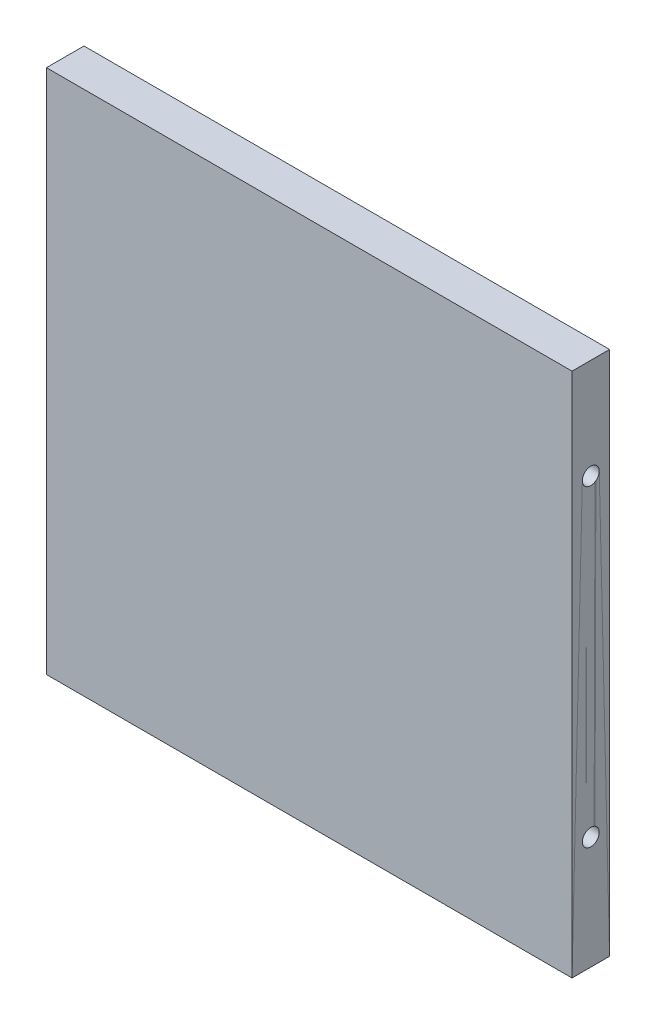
ISO-10303-21;
HEADER;
FILE_DESCRIPTION(('STEP AP214'),'2;1');
FILE_NAME('part.step','',(''),(''),'','','');
FILE_SCHEMA(('AUTOMOTIVE_DESIGN { 1 0 10303 214 1 1 1 1 }'));
ENDSEC;
DATA;
#1=APPLICATION_CONTEXT('core data for automotive mechanical design processes');
#2=APPLICATION_PROTOCOL_DEFINITION('international standard','automotive_design',2000,#1);
#3=PRODUCT_CONTEXT('',#1,'mechanical');
#4=PRODUCT('Part','Part','',(#3));
#5=PRODUCT_RELATED_PRODUCT_CATEGORY('part','',(#4));
#6=PRODUCT_DEFINITION_FORMATION('','',#4);
#7=PRODUCT_DEFINITION_CONTEXT('part definition',#1,'design');
#8=PRODUCT_DEFINITION('design','',#6,#7);
#9=PRODUCT_DEFINITION_SHAPE('','',#8);
#10=(LENGTH_UNIT() NAMED_UNIT(*) SI_UNIT(.MILLI.,.METRE.));
#11=(NAMED_UNIT(*) PLANE_ANGLE_UNIT() SI_UNIT($,.RADIAN.));
#12=(NAMED_UNIT(*) SI_UNIT($,.STERADIAN.) SOLID_ANGLE_UNIT());
#13=UNCERTAINTY_MEASURE_WITH_UNIT(LENGTH_MEASURE(1.E-05),#10,'distance_accuracy_value','');
#14=(GEOMETRIC_REPRESENTATION_CONTEXT(3) GLOBAL_UNCERTAINTY_ASSIGNED_CONTEXT((#13)) GLOBAL_UNIT_ASSIGNED_CONTEXT((#10,
#11,#12)) REPRESENTATION_CONTEXT('',''));
#15=CARTESIAN_POINT('',(0.,0.,0.));
#16=DIRECTION('',(0.,0.,1.));
#17=DIRECTION('',(1.,0.,0.));
#18=AXIS2_PLACEMENT_3D('',#15,#16,#17);
#19=CARTESIAN_POINT('',(120.,45.,-7.5));
#20=DIRECTION('',(1.,0.,0.));
#21=DIRECTION('',(0.,0.,-1.));
#22=AXIS2_PLACEMENT_3D('',#19,#20,#21);
#23=CONICAL_SURFACE('',#22,3.37499999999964,1.04719755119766);
#24=CARTESIAN_POINT('',(120.,45.,-7.5));
#25=DIRECTION('',(-1.,0.,0.));
#26=DIRECTION('',(0.,-0.8090169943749,-0.587785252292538));
#27=AXIS2_PLACEMENT_3D('',#24,#25,#26);
#28=CIRCLE('',#27,3.37499999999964);
#29=CARTESIAN_POINT('',(120.,42.269567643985,-9.4837752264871));
#30=VERTEX_POINT('',#29);
#31=EDGE_CURVE('P0_E515',#30,#30,#28,.T.);
#32=ORIENTED_EDGE('',*,*,#31,.F.);
#33=EDGE_LOOP('',(#32));
#34=FACE_BOUND('',#33,.T.);
#35=CARTESIAN_POINT('',(118.05144284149,45.,-7.5));
#36=VERTEX_POINT('',#35);
#37=VERTEX_LOOP('',#36);
#38=FACE_BOUND('',#37,.T.);
#39=ADVANCED_FACE('P0_F348',(#34,#38),#23,.F.);
#40=CARTESIAN_POINT('',(120.,170.,-7.5));
#41=DIRECTION('',(1.,0.,0.));
#42=DIRECTION('',(0.,0.,-1.));
#43=AXIS2_PLACEMENT_3D('',#40,#41,#42);
#44=CONICAL_SURFACE('',#43,3.37500000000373,1.04719755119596);
#45=CARTESIAN_POINT('',(120.,170.,-7.5));
#46=DIRECTION('',(-1.,0.,0.));
#47=DIRECTION('',(0.,-0.809016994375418,-0.587785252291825));
#48=AXIS2_PLACEMENT_3D('',#45,#46,#47);
#49=CIRCLE('',#48,3.37500000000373);
#50=CARTESIAN_POINT('',(120.,167.26956764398,-9.4837752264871));
#51=VERTEX_POINT('',#50);
#52=EDGE_CURVE('P0_E511',#51,#51,#49,.T.);
#53=ORIENTED_EDGE('',*,*,#52,.F.);
#54=EDGE_LOOP('',(#53));
#55=FACE_BOUND('',#54,.T.);
#56=CARTESIAN_POINT('',(118.05144284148,170.,-7.5));
#57=VERTEX_POINT('',#56);
#58=VERTEX_LOOP('',#57);
#59=FACE_BOUND('',#58,.T.);
#60=ADVANCED_FACE('P0_F408',(#55,#59),#44,.F.);
#61=CARTESIAN_POINT('',(-28.051442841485,45.,-7.5));
#62=DIRECTION('',(-1.,0.,0.));
#63=DIRECTION('',(0.,0.,1.));
#64=AXIS2_PLACEMENT_3D('',#61,#62,#63);
#65=CONICAL_SURFACE('',#64,0.,1.04719755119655);
#66=CARTESIAN_POINT('',(-30.,45.,-7.5));
#67=DIRECTION('',(-1.,0.,0.));
#68=DIRECTION('',(0.,-0.8090169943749,-0.587785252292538));
#69=AXIS2_PLACEMENT_3D('',#66,#67,#68);
#70=CIRCLE('',#69,3.37499999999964);
#71=CARTESIAN_POINT('',(-30.,42.269567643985,-9.4837752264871));
#72=VERTEX_POINT('',#71);
#73=EDGE_CURVE('P0_E509',#72,#72,#70,.F.);
#74=ORIENTED_EDGE('',*,*,#73,.F.);
#75=EDGE_LOOP('',(#74));
#76=FACE_BOUND('',#75,.T.);
#77=CARTESIAN_POINT('',(-28.051442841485,45.,-7.5));
#78=VERTEX_POINT('',#77);
#79=VERTEX_LOOP('',#78);
#80=FACE_BOUND('',#79,.T.);
#81=ADVANCED_FACE('P0_F414',(#76,#80),#65,.F.);
#82=CARTESIAN_POINT('',(-28.051442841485,170.,-7.5));
#83=DIRECTION('',(-1.,0.,0.));
#84=DIRECTION('',(0.,0.,1.));
#85=AXIS2_PLACEMENT_3D('',#82,#83,#84);
#86=CONICAL_SURFACE('',#85,0.,1.04719755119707);
#87=CARTESIAN_POINT('',(-30.,170.,-7.5));
#88=DIRECTION('',(-1.,0.,0.));
#89=DIRECTION('',(0.,-0.809016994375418,-0.587785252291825));
#90=AXIS2_PLACEMENT_3D('',#87,#88,#89);
#91=CIRCLE('',#90,3.37500000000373);
#92=CARTESIAN_POINT('',(-30.,167.26956764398,-9.4837752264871));
#93=VERTEX_POINT('',#92);
#94=EDGE_CURVE('P0_E468',#93,#93,#91,.F.);
#95=ORIENTED_EDGE('',*,*,#94,.F.);
#96=EDGE_LOOP('',(#95));
#97=FACE_BOUND('',#96,.T.);
#98=CARTESIAN_POINT('',(-28.051442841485,170.,-7.5));
#99=VERTEX_POINT('',#98);
#100=VERTEX_LOOP('',#99);
#101=FACE_BOUND('',#100,.T.);
#102=ADVANCED_FACE('P0_F497',(#97,#101),#86,.F.);
#103=CARTESIAN_POINT('',(150.,45.,-7.5));
#104=DIRECTION('',(-1.,0.,0.));
#105=DIRECTION('',(0.,0.,1.));
#106=AXIS2_PLACEMENT_3D('',#103,#104,#105);
#107=CYLINDRICAL_SURFACE('',#106,3.37499999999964);
#108=CARTESIAN_POINT('',(150.,45.,-7.5));
#109=DIRECTION('',(-1.,0.,0.));
#110=DIRECTION('',(0.,0.,1.));
#111=AXIS2_PLACEMENT_3D('',#108,#109,#110);
#112=CIRCLE('',#111,3.37499999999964);
#113=CARTESIAN_POINT('',(150.,45.,-4.12500000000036));
#114=VERTEX_POINT('',#113);
#115=EDGE_CURVE('P0_E352',#114,#114,#112,.T.);
#116=ORIENTED_EDGE('',*,*,#115,.F.);
#117=EDGE_LOOP('',(#116));
#118=FACE_BOUND('',#117,.T.);
#119=ORIENTED_EDGE('',*,*,#31,.T.);
#120=EDGE_LOOP('',(#119));
#121=FACE_BOUND('',#120,.T.);
#122=ADVANCED_FACE('P0_F493',(#118,#121),#107,.F.);
#123=CARTESIAN_POINT('',(150.,170.,-7.5));
#124=DIRECTION('',(-1.,0.,0.));
#125=DIRECTION('',(0.,0.,1.));
#126=AXIS2_PLACEMENT_3D('',#123,#124,#125);
#127=CYLINDRICAL_SURFACE('',#126,3.37500000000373);
#128=CARTESIAN_POINT('',(150.,170.,-7.5));
#129=DIRECTION('',(-1.,0.,0.));
#130=DIRECTION('',(0.,0.,1.));
#131=AXIS2_PLACEMENT_3D('',#128,#129,#130);
#132=CIRCLE('',#131,3.37500000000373);
#133=CARTESIAN_POINT('',(150.,170.,-4.12499999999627));
#134=VERTEX_POINT('',#133);
#135=EDGE_CURVE('P0_E442',#134,#134,#132,.T.);
#136=ORIENTED_EDGE('',*,*,#135,.F.);
#137=EDGE_LOOP('',(#136));
#138=FACE_BOUND('',#137,.T.);
#139=ORIENTED_EDGE('',*,*,#52,.T.);
#140=EDGE_LOOP('',(#139));
#141=FACE_BOUND('',#140,.T.);
#142=ADVANCED_FACE('P0_F484',(#138,#141),#127,.F.);
#143=CARTESIAN_POINT('',(150.,0.,-15.));
#144=DIRECTION('',(0.,0.,-1.));
#145=DIRECTION('',(-1.,0.,0.));
#146=AXIS2_PLACEMENT_3D('',#143,#144,#145);
#147=PLANE('',#146);
#148=DIRECTION('',(0.,1.,0.));
#149=VECTOR('',#148,1.);
#150=CARTESIAN_POINT('',(150.,105.,-14.9999999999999));
#151=LINE('',#150,#149);
#152=CARTESIAN_POINT('',(150.,0.,-14.9999999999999));
#153=VERTEX_POINT('',#152);
#154=CARTESIAN_POINT('',(150.,210.,-14.9999999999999));
#155=VERTEX_POINT('',#154);
#156=EDGE_CURVE('P0_E450',#153,#155,#151,.T.);
#157=ORIENTED_EDGE('',*,*,#156,.F.);
#158=DIRECTION('',(1.,0.,0.));
#159=VECTOR('',#158,1.);
#160=CARTESIAN_POINT('',(45.,0.,-14.9999999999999));
#161=LINE('',#160,#159);
#162=CARTESIAN_POINT('',(-60.,0.,-15.));
#163=VERTEX_POINT('',#162);
#164=EDGE_CURVE('P0_E388',#163,#153,#161,.T.);
#165=ORIENTED_EDGE('',*,*,#164,.F.);
#166=DIRECTION('',(0.,-1.,0.));
#167=VECTOR('',#166,1.);
#168=CARTESIAN_POINT('',(-60.,105.,-14.9999999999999));
#169=LINE('',#168,#167);
#170=CARTESIAN_POINT('',(-60.,210.,-14.9999999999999));
#171=VERTEX_POINT('',#170);
#172=EDGE_CURVE('P0_E464',#171,#163,#169,.T.);
#173=ORIENTED_EDGE('',*,*,#172,.F.);
#174=DIRECTION('',(-1.,0.,0.));
#175=VECTOR('',#174,1.);
#176=CARTESIAN_POINT('',(45.,210.,-14.9999999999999));
#177=LINE('',#176,#175);
#178=EDGE_CURVE('P0_E447',#155,#171,#177,.T.);
#179=ORIENTED_EDGE('',*,*,#178,.F.);
#180=EDGE_LOOP('',(#157,#165,#173,#179));
#181=FACE_BOUND('',#180,.T.);
#182=ADVANCED_FACE('P0_F469',(#181),#147,.T.);
#183=CARTESIAN_POINT('',(-30.,45.,-7.5));
#184=DIRECTION('',(-1.,0.,0.));
#185=DIRECTION('',(0.,0.,1.));
#186=AXIS2_PLACEMENT_3D('',#183,#184,#185);
#187=CYLINDRICAL_SURFACE('',#186,3.37499999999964);
#188=CARTESIAN_POINT('',(-60.,45.,-7.49999999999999));
#189=DIRECTION('',(-1.,0.,0.));
#190=DIRECTION('',(0.,0.,1.));
#191=AXIS2_PLACEMENT_3D('',#188,#189,#190);
#192=CIRCLE('',#191,3.37499999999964);
#193=CARTESIAN_POINT('',(-60.,45.,-4.12500000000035));
#194=VERTEX_POINT('',#193);
#195=EDGE_CURVE('P0_E439',#194,#194,#192,.F.);
#196=ORIENTED_EDGE('',*,*,#195,.F.);
#197=EDGE_LOOP('',(#196));
#198=FACE_BOUND('',#197,.T.);
#199=ORIENTED_EDGE('',*,*,#73,.T.);
#200=EDGE_LOOP('',(#199));
#201=FACE_BOUND('',#200,.T.);
#202=ADVANCED_FACE('P0_F483',(#198,#201),#187,.F.);
#203=CARTESIAN_POINT('',(-30.,170.,-7.5));
#204=DIRECTION('',(-1.,0.,0.));
#205=DIRECTION('',(0.,0.,1.));
#206=AXIS2_PLACEMENT_3D('',#203,#204,#205);
#207=CYLINDRICAL_SURFACE('',#206,3.37500000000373);
#208=CARTESIAN_POINT('',(-60.,170.,-7.49999999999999));
#209=DIRECTION('',(-1.,0.,0.));
#210=DIRECTION('',(0.,0.,1.));
#211=AXIS2_PLACEMENT_3D('',#208,#209,#210);
#212=CIRCLE('',#211,3.37500000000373);
#213=CARTESIAN_POINT('',(-60.,170.,-4.12499999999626));
#214=VERTEX_POINT('',#213);
#215=EDGE_CURVE('P0_E436',#214,#214,#212,.F.);
#216=ORIENTED_EDGE('',*,*,#215,.F.);
#217=EDGE_LOOP('',(#216));
#218=FACE_BOUND('',#217,.T.);
#219=ORIENTED_EDGE('',*,*,#94,.T.);
#220=EDGE_LOOP('',(#219));
#221=FACE_BOUND('',#220,.T.);
#222=ADVANCED_FACE('P0_F480',(#218,#221),#207,.F.);
#223=CARTESIAN_POINT('',(-60.,0.,0.));
#224=DIRECTION('',(0.,-1.,0.));
#225=DIRECTION('',(0.,0.,-1.));
#226=AXIS2_PLACEMENT_3D('',#223,#224,#225);
#227=PLANE('',#226);
#228=ORIENTED_EDGE('',*,*,#164,.T.);
#229=DIRECTION('',(0.,0.,-1.));
#230=VECTOR('',#229,1.);
#231=CARTESIAN_POINT('',(150.,0.,-105.));
#232=LINE('',#231,#230);
#233=CARTESIAN_POINT('',(150.,0.,0.));
#234=VERTEX_POINT('',#233);
#235=EDGE_CURVE('P0_E453',#234,#153,#232,.T.);
#236=ORIENTED_EDGE('',*,*,#235,.F.);
#237=DIRECTION('',(1.,0.,0.));
#238=VECTOR('',#237,1.);
#239=CARTESIAN_POINT('',(45.,0.,0.));
#240=LINE('',#239,#238);
#241=CARTESIAN_POINT('',(-60.,0.,0.));
#242=VERTEX_POINT('',#241);
#243=EDGE_CURVE('P0_E381',#242,#234,#240,.T.);
#244=ORIENTED_EDGE('',*,*,#243,.F.);
#245=DIRECTION('',(0.,0.,1.));
#246=VECTOR('',#245,1.);
#247=CARTESIAN_POINT('',(-60.,0.,-105.));
#248=LINE('',#247,#246);
#249=EDGE_CURVE('P0_E441',#163,#242,#248,.T.);
#250=ORIENTED_EDGE('',*,*,#249,.F.);
#251=EDGE_LOOP('',(#228,#236,#244,#250));
#252=FACE_BOUND('',#251,.T.);
#253=ADVANCED_FACE('P0_F467',(#252),#227,.T.);
#254=CARTESIAN_POINT('',(150.,0.,0.));
#255=DIRECTION('',(1.,0.,0.));
#256=DIRECTION('',(0.,0.,-1.));
#257=AXIS2_PLACEMENT_3D('',#254,#255,#256);
#258=PLANE('',#257);
#259=ORIENTED_EDGE('',*,*,#135,.T.);
#260=EDGE_LOOP('',(#259));
#261=FACE_BOUND('',#260,.T.);
#262=ORIENTED_EDGE('',*,*,#115,.T.);
#263=EDGE_LOOP('',(#262));
#264=FACE_BOUND('',#263,.T.);
#265=DIRECTION('',(0.,0.,-1.));
#266=VECTOR('',#265,1.);
#267=CARTESIAN_POINT('',(150.,210.,-105.));
#268=LINE('',#267,#266);
#269=CARTESIAN_POINT('',(150.,210.,0.));
#270=VERTEX_POINT('',#269);
#271=EDGE_CURVE('P0_E444',#270,#155,#268,.T.);
#272=ORIENTED_EDGE('',*,*,#271,.F.);
#273=DIRECTION('',(0.,1.,0.));
#274=VECTOR('',#273,1.);
#275=CARTESIAN_POINT('',(150.,105.,0.));
#276=LINE('',#275,#274);
#277=EDGE_CURVE('P0_E429',#234,#270,#276,.T.);
#278=ORIENTED_EDGE('',*,*,#277,.F.);
#279=ORIENTED_EDGE('',*,*,#235,.T.);
#280=ORIENTED_EDGE('',*,*,#156,.T.);
#281=EDGE_LOOP('',(#272,#278,#279,#280));
#282=FACE_BOUND('',#281,.T.);
#283=ADVANCED_FACE('P0_F470',(#261,#264,#282),#258,.T.);
#284=CARTESIAN_POINT('',(150.,210.,0.));
#285=DIRECTION('',(0.,1.,0.));
#286=DIRECTION('',(0.,0.,-1.));
#287=AXIS2_PLACEMENT_3D('',#284,#285,#286);
#288=PLANE('',#287);
#289=ORIENTED_EDGE('',*,*,#178,.T.);
#290=DIRECTION('',(0.,0.,-1.));
#291=VECTOR('',#290,1.);
#292=CARTESIAN_POINT('',(-60.,210.,-105.));
#293=LINE('',#292,#291);
#294=CARTESIAN_POINT('',(-60.,210.,0.));
#295=VERTEX_POINT('',#294);
#296=EDGE_CURVE('P0_E367',#295,#171,#293,.T.);
#297=ORIENTED_EDGE('',*,*,#296,.F.);
#298=DIRECTION('',(-1.,0.,0.));
#299=VECTOR('',#298,1.);
#300=CARTESIAN_POINT('',(45.,210.,0.));
#301=LINE('',#300,#299);
#302=EDGE_CURVE('P0_E358',#270,#295,#301,.T.);
#303=ORIENTED_EDGE('',*,*,#302,.F.);
#304=ORIENTED_EDGE('',*,*,#271,.T.);
#305=EDGE_LOOP('',(#289,#297,#303,#304));
#306=FACE_BOUND('',#305,.T.);
#307=ADVANCED_FACE('P0_F424',(#306),#288,.T.);
#308=CARTESIAN_POINT('',(-60.,210.,0.));
#309=DIRECTION('',(-1.,0.,0.));
#310=DIRECTION('',(0.,0.,-1.));
#311=AXIS2_PLACEMENT_3D('',#308,#309,#310);
#312=PLANE('',#311);
#313=ORIENTED_EDGE('',*,*,#215,.T.);
#314=EDGE_LOOP('',(#313));
#315=FACE_BOUND('',#314,.T.);
#316=ORIENTED_EDGE('',*,*,#195,.T.);
#317=EDGE_LOOP('',(#316));
#318=FACE_BOUND('',#317,.T.);
#319=ORIENTED_EDGE('',*,*,#172,.T.);
#320=ORIENTED_EDGE('',*,*,#249,.T.);
#321=DIRECTION('',(0.,-1.,0.));
#322=VECTOR('',#321,1.);
#323=CARTESIAN_POINT('',(-60.,105.,0.));
#324=LINE('',#323,#322);
#325=EDGE_CURVE('P0_E11',#295,#242,#324,.T.);
#326=ORIENTED_EDGE('',*,*,#325,.F.);
#327=ORIENTED_EDGE('',*,*,#296,.T.);
#328=EDGE_LOOP('',(#319,#320,#326,#327));
#329=FACE_BOUND('',#328,.T.);
#330=ADVANCED_FACE('P0_F419',(#315,#318,#329),#312,.T.);
#331=CARTESIAN_POINT('',(-60.,0.,0.));
#332=DIRECTION('',(0.,0.,1.));
#333=DIRECTION('',(1.,0.,0.));
#334=AXIS2_PLACEMENT_3D('',#331,#332,#333);
#335=PLANE('',#334);
#336=ORIENTED_EDGE('',*,*,#302,.T.);
#337=ORIENTED_EDGE('',*,*,#325,.T.);
#338=ORIENTED_EDGE('',*,*,#243,.T.);
#339=ORIENTED_EDGE('',*,*,#277,.T.);
#340=EDGE_LOOP('',(#336,#337,#338,#339));
#341=FACE_BOUND('',#340,.T.);
#342=ADVANCED_FACE('P0_F350',(#341),#335,.T.);
#343=CLOSED_SHELL('',(#39,#60,#81,#102,#122,#142,#182,#202,#222,#253,#283,#307,#330,#342));
#344=MANIFOLD_SOLID_BREP('P0_B2',#343);
#345=CARTESIAN_POINT('',(120.,45.,-7.5));
#346=DIRECTION('',(1.,0.,0.));
#347=DIRECTION('',(0.,0.,-1.));
#348=AXIS2_PLACEMENT_3D('',#345,#346,#347);
#349=CONICAL_SURFACE('',#348,3.37499999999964,1.04719755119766);
#350=CARTESIAN_POINT('',(120.,45.,-7.5));
#351=DIRECTION('',(-1.,0.,0.));
#352=DIRECTION('',(0.,-0.8090169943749,-0.587785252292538));
#353=AXIS2_PLACEMENT_3D('',#350,#351,#352);
#354=CIRCLE('',#353,3.37499999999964);
#355=CARTESIAN_POINT('',(120.,42.269567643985,-9.4837752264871));
#356=VERTEX_POINT('',#355);
#357=EDGE_CURVE('P1_E179',#356,#356,#354,.T.);
#358=ORIENTED_EDGE('',*,*,#357,.F.);
#359=EDGE_LOOP('',(#358));
#360=FACE_BOUND('',#359,.T.);
#361=CARTESIAN_POINT('',(118.05144284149,45.,-7.5));
#362=VERTEX_POINT('',#361);
#363=VERTEX_LOOP('',#362);
#364=FACE_BOUND('',#363,.T.);
#365=ADVANCED_FACE('P1_F15',(#360,#364),#349,.F.);
#366=CARTESIAN_POINT('',(120.,170.,-7.5));
#367=DIRECTION('',(1.,0.,0.));
#368=DIRECTION('',(0.,0.,-1.));
#369=AXIS2_PLACEMENT_3D('',#366,#367,#368);
#370=CONICAL_SURFACE('',#369,3.37500000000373,1.04719755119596);
#371=CARTESIAN_POINT('',(120.,170.,-7.5));
#372=DIRECTION('',(-1.,0.,0.));
#373=DIRECTION('',(0.,-0.809016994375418,-0.587785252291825));
#374=AXIS2_PLACEMENT_3D('',#371,#372,#373);
#375=CIRCLE('',#374,3.37500000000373);
#376=CARTESIAN_POINT('',(120.,167.26956764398,-9.4837752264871));
#377=VERTEX_POINT('',#376);
#378=EDGE_CURVE('P1_E175',#377,#377,#375,.T.);
#379=ORIENTED_EDGE('',*,*,#378,.F.);
#380=EDGE_LOOP('',(#379));
#381=FACE_BOUND('',#380,.T.);
#382=CARTESIAN_POINT('',(118.05144284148,170.,-7.5));
#383=VERTEX_POINT('',#382);
#384=VERTEX_LOOP('',#383);
#385=FACE_BOUND('',#384,.T.);
#386=ADVANCED_FACE('P1_F75',(#381,#385),#370,.F.);
#387=CARTESIAN_POINT('',(-28.051442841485,45.,-7.5));
#388=DIRECTION('',(-1.,0.,0.));
#389=DIRECTION('',(0.,0.,1.));
#390=AXIS2_PLACEMENT_3D('',#387,#388,#389);
#391=CONICAL_SURFACE('',#390,0.,1.04719755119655);
#392=CARTESIAN_POINT('',(-30.,45.,-7.5));
#393=DIRECTION('',(-1.,0.,0.));
#394=DIRECTION('',(0.,-0.8090169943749,-0.587785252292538));
#395=AXIS2_PLACEMENT_3D('',#392,#393,#394);
#396=CIRCLE('',#395,3.37499999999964);
#397=CARTESIAN_POINT('',(-30.,42.269567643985,-9.4837752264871));
#398=VERTEX_POINT('',#397);
#399=EDGE_CURVE('P1_E173',#398,#398,#396,.F.);
#400=ORIENTED_EDGE('',*,*,#399,.F.);
#401=EDGE_LOOP('',(#400));
#402=FACE_BOUND('',#401,.T.);
#403=CARTESIAN_POINT('',(-28.051442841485,45.,-7.5));
#404=VERTEX_POINT('',#403);
#405=VERTEX_LOOP('',#404);
#406=FACE_BOUND('',#405,.T.);
#407=ADVANCED_FACE('P1_F81',(#402,#406),#391,.F.);
#408=CARTESIAN_POINT('',(-28.051442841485,170.,-7.5));
#409=DIRECTION('',(-1.,0.,0.));
#410=DIRECTION('',(0.,0.,1.));
#411=AXIS2_PLACEMENT_3D('',#408,#409,#410);
#412=CONICAL_SURFACE('',#411,0.,1.04719755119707);
#413=CARTESIAN_POINT('',(-30.,170.,-7.5));
#414=DIRECTION('',(-1.,0.,0.));
#415=DIRECTION('',(0.,-0.809016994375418,-0.587785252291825));
#416=AXIS2_PLACEMENT_3D('',#413,#414,#415);
#417=CIRCLE('',#416,3.37500000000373);
#418=CARTESIAN_POINT('',(-30.,167.26956764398,-9.4837752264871));
#419=VERTEX_POINT('',#418);
#420=EDGE_CURVE('P1_E134',#419,#419,#417,.F.);
#421=ORIENTED_EDGE('',*,*,#420,.F.);
#422=EDGE_LOOP('',(#421));
#423=FACE_BOUND('',#422,.T.);
#424=CARTESIAN_POINT('',(-28.051442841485,170.,-7.5));
#425=VERTEX_POINT('',#424);
#426=VERTEX_LOOP('',#425);
#427=FACE_BOUND('',#426,.T.);
#428=ADVANCED_FACE('P1_F162',(#423,#427),#412,.F.);
#429=CARTESIAN_POINT('',(150.,45.,-7.5));
#430=DIRECTION('',(-1.,0.,0.));
#431=DIRECTION('',(0.,0.,1.));
#432=AXIS2_PLACEMENT_3D('',#429,#430,#431);
#433=CYLINDRICAL_SURFACE('',#432,3.37499999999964);
#434=CARTESIAN_POINT('',(150.,45.,-7.5));
#435=DIRECTION('',(-1.,0.,0.));
#436=DIRECTION('',(0.,0.,1.));
#437=AXIS2_PLACEMENT_3D('',#434,#435,#436);
#438=CIRCLE('',#437,3.37499999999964);
#439=CARTESIAN_POINT('',(150.,45.,-4.12500000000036));
#440=VERTEX_POINT('',#439);
#441=EDGE_CURVE('P1_E19',#440,#440,#438,.T.);
#442=ORIENTED_EDGE('',*,*,#441,.F.);
#443=EDGE_LOOP('',(#442));
#444=FACE_BOUND('',#443,.T.);
#445=ORIENTED_EDGE('',*,*,#357,.T.);
#446=EDGE_LOOP('',(#445));
#447=FACE_BOUND('',#446,.T.);
#448=ADVANCED_FACE('P1_F158',(#444,#447),#433,.F.);
#449=CARTESIAN_POINT('',(150.,170.,-7.5));
#450=DIRECTION('',(-1.,0.,0.));
#451=DIRECTION('',(0.,0.,1.));
#452=AXIS2_PLACEMENT_3D('',#449,#450,#451);
#453=CYLINDRICAL_SURFACE('',#452,3.37500000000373);
#454=CARTESIAN_POINT('',(150.,170.,-7.5));
#455=DIRECTION('',(-1.,0.,0.));
#456=DIRECTION('',(0.,0.,1.));
#457=AXIS2_PLACEMENT_3D('',#454,#455,#456);
#458=CIRCLE('',#457,3.37500000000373);
#459=CARTESIAN_POINT('',(150.,170.,-4.12499999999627));
#460=VERTEX_POINT('',#459);
#461=EDGE_CURVE('P1_E108',#460,#460,#458,.T.);
#462=ORIENTED_EDGE('',*,*,#461,.F.);
#463=EDGE_LOOP('',(#462));
#464=FACE_BOUND('',#463,.T.);
#465=ORIENTED_EDGE('',*,*,#378,.T.);
#466=EDGE_LOOP('',(#465));
#467=FACE_BOUND('',#466,.T.);
#468=ADVANCED_FACE('P1_F149',(#464,#467),#453,.F.);
#469=CARTESIAN_POINT('',(150.,0.,-15.));
#470=DIRECTION('',(0.,0.,-1.));
#471=DIRECTION('',(-1.,0.,0.));
#472=AXIS2_PLACEMENT_3D('',#469,#470,#471);
#473=PLANE('',#472);
#474=DIRECTION('',(0.,1.,0.));
#475=VECTOR('',#474,1.);
#476=CARTESIAN_POINT('',(150.,105.,-14.9999999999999));
#477=LINE('',#476,#475);
#478=CARTESIAN_POINT('',(150.,0.,-14.9999999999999));
#479=VERTEX_POINT('',#478);
#480=CARTESIAN_POINT('',(150.,210.,-14.9999999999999));
#481=VERTEX_POINT('',#480);
#482=EDGE_CURVE('P1_E116',#479,#481,#477,.T.);
#483=ORIENTED_EDGE('',*,*,#482,.F.);
#484=DIRECTION('',(1.,0.,0.));
#485=VECTOR('',#484,1.);
#486=CARTESIAN_POINT('',(45.,0.,-14.9999999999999));
#487=LINE('',#486,#485);
#488=CARTESIAN_POINT('',(-60.,0.,-15.));
#489=VERTEX_POINT('',#488);
#490=EDGE_CURVE('P1_E55',#489,#479,#487,.T.);
#491=ORIENTED_EDGE('',*,*,#490,.F.);
#492=DIRECTION('',(0.,-1.,0.));
#493=VECTOR('',#492,1.);
#494=CARTESIAN_POINT('',(-60.,105.,-14.9999999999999));
#495=LINE('',#494,#493);
#496=CARTESIAN_POINT('',(-60.,210.,-14.9999999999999));
#497=VERTEX_POINT('',#496);
#498=EDGE_CURVE('P1_E130',#497,#489,#495,.T.);
#499=ORIENTED_EDGE('',*,*,#498,.F.);
#500=DIRECTION('',(-1.,0.,0.));
#501=VECTOR('',#500,1.);
#502=CARTESIAN_POINT('',(45.,210.,-14.9999999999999));
#503=LINE('',#502,#501);
#504=EDGE_CURVE('P1_E113',#481,#497,#503,.T.);
#505=ORIENTED_EDGE('',*,*,#504,.F.);
#506=EDGE_LOOP('',(#483,#491,#499,#505));
#507=FACE_BOUND('',#506,.T.);
#508=ADVANCED_FACE('P1_F135',(#507),#473,.T.);
#509=CARTESIAN_POINT('',(-30.,45.,-7.5));
#510=DIRECTION('',(-1.,0.,0.));
#511=DIRECTION('',(0.,0.,1.));
#512=AXIS2_PLACEMENT_3D('',#509,#510,#511);
#513=CYLINDRICAL_SURFACE('',#512,3.37499999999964);
#514=CARTESIAN_POINT('',(-60.,45.,-7.49999999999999));
#515=DIRECTION('',(-1.,0.,0.));
#516=DIRECTION('',(0.,0.,1.));
#517=AXIS2_PLACEMENT_3D('',#514,#515,#516);
#518=CIRCLE('',#517,3.37499999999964);
#519=CARTESIAN_POINT('',(-60.,45.,-4.12500000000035));
#520=VERTEX_POINT('',#519);
#521=EDGE_CURVE('P1_E105',#520,#520,#518,.F.);
#522=ORIENTED_EDGE('',*,*,#521,.F.);
#523=EDGE_LOOP('',(#522));
#524=FACE_BOUND('',#523,.T.);
#525=ORIENTED_EDGE('',*,*,#399,.T.);
#526=EDGE_LOOP('',(#525));
#527=FACE_BOUND('',#526,.T.);
#528=ADVANCED_FACE('P1_F148',(#524,#527),#513,.F.);
#529=CARTESIAN_POINT('',(-30.,170.,-7.5));
#530=DIRECTION('',(-1.,0.,0.));
#531=DIRECTION('',(0.,0.,1.));
#532=AXIS2_PLACEMENT_3D('',#529,#530,#531);
#533=CYLINDRICAL_SURFACE('',#532,3.37500000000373);
#534=CARTESIAN_POINT('',(-60.,170.,-7.49999999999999));
#535=DIRECTION('',(-1.,0.,0.));
#536=DIRECTION('',(0.,0.,1.));
#537=AXIS2_PLACEMENT_3D('',#534,#535,#536);
#538=CIRCLE('',#537,3.37500000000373);
#539=CARTESIAN_POINT('',(-60.,170.,-4.12499999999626));
#540=VERTEX_POINT('',#539);
#541=EDGE_CURVE('P1_E102',#540,#540,#538,.F.);
#542=ORIENTED_EDGE('',*,*,#541,.F.);
#543=EDGE_LOOP('',(#542));
#544=FACE_BOUND('',#543,.T.);
#545=ORIENTED_EDGE('',*,*,#420,.T.);
#546=EDGE_LOOP('',(#545));
#547=FACE_BOUND('',#546,.T.);
#548=ADVANCED_FACE('P1_F145',(#544,#547),#533,.F.);
#549=CARTESIAN_POINT('',(-60.,0.,0.));
#550=DIRECTION('',(0.,-1.,0.));
#551=DIRECTION('',(0.,0.,-1.));
#552=AXIS2_PLACEMENT_3D('',#549,#550,#551);
#553=PLANE('',#552);
#554=ORIENTED_EDGE('',*,*,#490,.T.);
#555=DIRECTION('',(0.,0.,-1.));
#556=VECTOR('',#555,1.);
#557=CARTESIAN_POINT('',(150.,0.,-105.));
#558=LINE('',#557,#556);
#559=CARTESIAN_POINT('',(150.,0.,0.));
#560=VERTEX_POINT('',#559);
#561=EDGE_CURVE('P1_E119',#560,#479,#558,.T.);
#562=ORIENTED_EDGE('',*,*,#561,.F.);
#563=DIRECTION('',(1.,0.,0.));
#564=VECTOR('',#563,1.);
#565=CARTESIAN_POINT('',(45.,0.,0.));
#566=LINE('',#565,#564);
#567=CARTESIAN_POINT('',(-60.,0.,0.));
#568=VERTEX_POINT('',#567);
#569=EDGE_CURVE('P1_E48',#568,#560,#566,.T.);
#570=ORIENTED_EDGE('',*,*,#569,.F.);
#571=DIRECTION('',(0.,0.,1.));
#572=VECTOR('',#571,1.);
#573=CARTESIAN_POINT('',(-60.,0.,-105.));
#574=LINE('',#573,#572);
#575=EDGE_CURVE('P1_E107',#489,#568,#574,.T.);
#576=ORIENTED_EDGE('',*,*,#575,.F.);
#577=EDGE_LOOP('',(#554,#562,#570,#576));
#578=FACE_BOUND('',#577,.T.);
#579=ADVANCED_FACE('P1_F133',(#578),#553,.T.);
#580=CARTESIAN_POINT('',(150.,0.,0.));
#581=DIRECTION('',(1.,0.,0.));
#582=DIRECTION('',(0.,0.,-1.));
#583=AXIS2_PLACEMENT_3D('',#580,#581,#582);
#584=PLANE('',#583);
#585=ORIENTED_EDGE('',*,*,#461,.T.);
#586=EDGE_LOOP('',(#585));
#587=FACE_BOUND('',#586,.T.);
#588=ORIENTED_EDGE('',*,*,#441,.T.);
#589=EDGE_LOOP('',(#588));
#590=FACE_BOUND('',#589,.T.);
#591=DIRECTION('',(0.,0.,-1.));
#592=VECTOR('',#591,1.);
#593=CARTESIAN_POINT('',(150.,210.,-105.));
#594=LINE('',#593,#592);
#595=CARTESIAN_POINT('',(150.,210.,0.));
#596=VERTEX_POINT('',#595);
#597=EDGE_CURVE('P1_E110',#596,#481,#594,.T.);
#598=ORIENTED_EDGE('',*,*,#597,.F.);
#599=DIRECTION('',(0.,1.,0.));
#600=VECTOR('',#599,1.);
#601=CARTESIAN_POINT('',(150.,105.,0.));
#602=LINE('',#601,#600);
#603=EDGE_CURVE('P1_E95',#560,#596,#602,.T.);
#604=ORIENTED_EDGE('',*,*,#603,.F.);
#605=ORIENTED_EDGE('',*,*,#561,.T.);
#606=ORIENTED_EDGE('',*,*,#482,.T.);
#607=EDGE_LOOP('',(#598,#604,#605,#606));
#608=FACE_BOUND('',#607,.T.);
#609=ADVANCED_FACE('P1_F136',(#587,#590,#608),#584,.T.);
#610=CARTESIAN_POINT('',(150.,210.,0.));
#611=DIRECTION('',(0.,1.,0.));
#612=DIRECTION('',(0.,0.,-1.));
#613=AXIS2_PLACEMENT_3D('',#610,#611,#612);
#614=PLANE('',#613);
#615=ORIENTED_EDGE('',*,*,#504,.T.);
#616=DIRECTION('',(0.,0.,-1.));
#617=VECTOR('',#616,1.);
#618=CARTESIAN_POINT('',(-60.,210.,-105.));
#619=LINE('',#618,#617);
#620=CARTESIAN_POINT('',(-60.,210.,0.));
#621=VERTEX_POINT('',#620);
#622=EDGE_CURVE('P1_E34',#621,#497,#619,.T.);
#623=ORIENTED_EDGE('',*,*,#622,.F.);
#624=DIRECTION('',(-1.,0.,0.));
#625=VECTOR('',#624,1.);
#626=CARTESIAN_POINT('',(45.,210.,0.));
#627=LINE('',#626,#625);
#628=EDGE_CURVE('P1_E25',#596,#621,#627,.T.);
#629=ORIENTED_EDGE('',*,*,#628,.F.);
#630=ORIENTED_EDGE('',*,*,#597,.T.);
#631=EDGE_LOOP('',(#615,#623,#629,#630));
#632=FACE_BOUND('',#631,.T.);
#633=ADVANCED_FACE('P1_F90',(#632),#614,.T.);
#634=CARTESIAN_POINT('',(-60.,210.,0.));
#635=DIRECTION('',(-1.,0.,0.));
#636=DIRECTION('',(0.,0.,-1.));
#637=AXIS2_PLACEMENT_3D('',#634,#635,#636);
#638=PLANE('',#637);
#639=ORIENTED_EDGE('',*,*,#541,.T.);
#640=EDGE_LOOP('',(#639));
#641=FACE_BOUND('',#640,.T.);
#642=ORIENTED_EDGE('',*,*,#521,.T.);
#643=EDGE_LOOP('',(#642));
#644=FACE_BOUND('',#643,.T.);
#645=ORIENTED_EDGE('',*,*,#498,.T.);
#646=ORIENTED_EDGE('',*,*,#575,.T.);
#647=DIRECTION('',(0.,-1.,0.));
#648=VECTOR('',#647,1.);
#649=CARTESIAN_POINT('',(-60.,105.,0.));
#650=LINE('',#649,#648);
#651=EDGE_CURVE('P1_E10',#621,#568,#650,.T.);
#652=ORIENTED_EDGE('',*,*,#651,.F.);
#653=ORIENTED_EDGE('',*,*,#622,.T.);
#654=EDGE_LOOP('',(#645,#646,#652,#653));
#655=FACE_BOUND('',#654,.T.);
#656=ADVANCED_FACE('P1_F86',(#641,#644,#655),#638,.T.);
#657=CARTESIAN_POINT('',(-60.,0.,0.));
#658=DIRECTION('',(0.,0.,1.));
#659=DIRECTION('',(1.,0.,0.));
#660=AXIS2_PLACEMENT_3D('',#657,#658,#659);
#661=PLANE('',#660);
#662=ORIENTED_EDGE('',*,*,#628,.T.);
#663=ORIENTED_EDGE('',*,*,#651,.T.);
#664=ORIENTED_EDGE('',*,*,#569,.T.);
#665=ORIENTED_EDGE('',*,*,#603,.T.);
#666=EDGE_LOOP('',(#662,#663,#664,#665));
#667=FACE_BOUND('',#666,.T.);
#668=ADVANCED_FACE('P1_F17',(#667),#661,.T.);
#669=CLOSED_SHELL('',(#365,#386,#407,#428,#448,#468,#508,#528,#548,#579,#609,#633,#656,#668));
#670=MANIFOLD_SOLID_BREP('P1_B1',#669);
#671=ADVANCED_BREP_SHAPE_REPRESENTATION('',(#18,#344,#670),#14);
#672=SHAPE_DEFINITION_REPRESENTATION(#9,#671);
ENDSEC;
END-ISO-10303-21;
